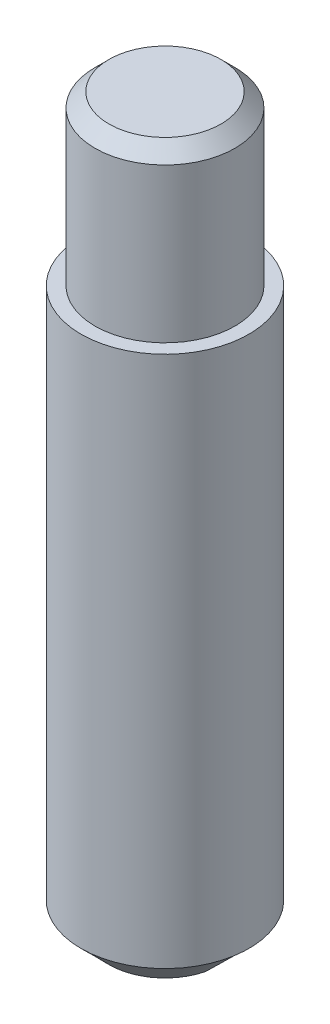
ISO-10303-21;
HEADER;
FILE_DESCRIPTION(('STEP AP214'),'2;1');
FILE_NAME('part.step','',(''),(''),'','','');
FILE_SCHEMA(('AUTOMOTIVE_DESIGN { 1 0 10303 214 1 1 1 1 }'));
ENDSEC;
DATA;
#1=APPLICATION_CONTEXT('core data for automotive mechanical design processes');
#2=APPLICATION_PROTOCOL_DEFINITION('international standard','automotive_design',2000,#1);
#3=PRODUCT_CONTEXT('',#1,'mechanical');
#4=PRODUCT('Part','Part','',(#3));
#5=PRODUCT_RELATED_PRODUCT_CATEGORY('part','',(#4));
#6=PRODUCT_DEFINITION_FORMATION('','',#4);
#7=PRODUCT_DEFINITION_CONTEXT('part definition',#1,'design');
#8=PRODUCT_DEFINITION('design','',#6,#7);
#9=PRODUCT_DEFINITION_SHAPE('','',#8);
#10=(LENGTH_UNIT() NAMED_UNIT(*) SI_UNIT(.MILLI.,.METRE.));
#11=(NAMED_UNIT(*) PLANE_ANGLE_UNIT() SI_UNIT($,.RADIAN.));
#12=(NAMED_UNIT(*) SI_UNIT($,.STERADIAN.) SOLID_ANGLE_UNIT());
#13=UNCERTAINTY_MEASURE_WITH_UNIT(LENGTH_MEASURE(1.E-05),#10,'distance_accuracy_value','');
#14=(GEOMETRIC_REPRESENTATION_CONTEXT(3) GLOBAL_UNCERTAINTY_ASSIGNED_CONTEXT((#13)) GLOBAL_UNIT_ASSIGNED_CONTEXT((#10,
#11,#12)) REPRESENTATION_CONTEXT('',''));
#15=CARTESIAN_POINT('',(0.,0.,0.));
#16=DIRECTION('',(0.,0.,1.));
#17=DIRECTION('',(1.,0.,0.));
#18=AXIS2_PLACEMENT_3D('',#15,#16,#17);
#19=CARTESIAN_POINT('',(0.,0.,0.));
#20=DIRECTION('',(0.,1.,0.));
#21=DIRECTION('',(0.,0.,1.));
#22=AXIS2_PLACEMENT_3D('',#19,#20,#21);
#23=PLANE('',#22);
#24=CARTESIAN_POINT('',(0.,0.,0.));
#25=DIRECTION('',(0.,1.,0.));
#26=DIRECTION('',(0.,0.,1.));
#27=AXIS2_PLACEMENT_3D('',#24,#25,#26);
#28=CIRCLE('',#27,1.99999999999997);
#29=CARTESIAN_POINT('',(-1.93649167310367,0.,-0.5));
#30=VERTEX_POINT('',#29);
#31=CARTESIAN_POINT('',(1.93649167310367,0.,-0.5));
#32=VERTEX_POINT('',#31);
#33=EDGE_CURVE('E92',#30,#32,#28,.F.);
#34=ORIENTED_EDGE('',*,*,#33,.T.);
#35=DIRECTION('',(1.,0.,0.));
#36=VECTOR('',#35,1.);
#37=CARTESIAN_POINT('',(-4.08603247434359,0.,-0.5));
#38=LINE('',#37,#36);
#39=EDGE_CURVE('E90',#30,#32,#38,.T.);
#40=ORIENTED_EDGE('',*,*,#39,.F.);
#41=EDGE_LOOP('',(#34,#40));
#42=FACE_BOUND('',#41,.T.);
#43=ADVANCED_FACE('F33',(#42),#23,.F.);
#44=CARTESIAN_POINT('',(0.,1.00000000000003,0.));
#45=DIRECTION('',(0.,1.,0.));
#46=DIRECTION('',(0.,0.,1.));
#47=AXIS2_PLACEMENT_3D('',#44,#45,#46);
#48=CONICAL_SURFACE('',#47,3.,0.785398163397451);
#49=CARTESIAN_POINT('',(-6.63103347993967,4.64985751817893,-0.5));
#50=CARTESIAN_POINT('',(-6.39629582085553,4.41579013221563,-0.5));
#51=CARTESIAN_POINT('',(-6.16152847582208,4.18175248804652,-0.5));
#52=CARTESIAN_POINT('',(-5.69188584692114,3.71376898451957,-0.5));
#53=CARTESIAN_POINT('',(-5.45701055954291,3.47982312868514,-0.5));
#54=CARTESIAN_POINT('',(-4.98691869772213,3.01187160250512,-0.5));
#55=CARTESIAN_POINT('',(-4.75170200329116,2.77786605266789,-0.5));
#56=CARTESIAN_POINT('',(-4.28105975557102,2.31008118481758,-0.5));
#57=CARTESIAN_POINT('',(-4.04563420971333,2.07630185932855,-0.5));
#58=CARTESIAN_POINT('',(-3.58442332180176,1.61900696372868,-0.5));
#59=CARTESIAN_POINT('',(-3.35865262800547,1.39547663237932,-0.5));
#60=CARTESIAN_POINT('',(-3.01954668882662,1.06061302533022,-0.5));
#61=CARTESIAN_POINT('',(-2.90643048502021,0.949058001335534,-0.5));
#62=CARTESIAN_POINT('',(-2.67999103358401,0.726160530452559,-0.5));
#63=CARTESIAN_POINT('',(-2.56666778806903,0.614818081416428,-0.5));
#64=CARTESIAN_POINT('',(-2.33977921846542,0.392498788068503,-0.5));
#65=CARTESIAN_POINT('',(-2.22621405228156,0.281521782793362,-0.5));
#66=CARTESIAN_POINT('',(-1.99861397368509,0.0600415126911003,-0.5));
#67=CARTESIAN_POINT('',(-1.88457904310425,-0.0504617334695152,-0.5));
#68=CARTESIAN_POINT('',(-1.65577376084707,-0.270666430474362,-0.5));
#69=CARTESIAN_POINT('',(-1.54100354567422,-0.38036802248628,-0.5));
#70=CARTESIAN_POINT('',(-1.36779766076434,-0.543800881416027,-0.5));
#71=CARTESIAN_POINT('',(-1.3098891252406,-0.598090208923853,-0.5));
#72=CARTESIAN_POINT('',(-1.19356388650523,-0.706121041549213,-0.5));
#73=CARTESIAN_POINT('',(-1.13514719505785,-0.759862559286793,-0.5));
#74=CARTESIAN_POINT('',(-1.04371167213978,-0.842784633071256,-0.5));
#75=CARTESIAN_POINT('',(-1.01095596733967,-0.872255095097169,-0.5));
#76=CARTESIAN_POINT('',(-0.945138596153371,-0.930859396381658,-0.5));
#77=CARTESIAN_POINT('',(-0.91207690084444,-0.959993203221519,-0.5));
#78=CARTESIAN_POINT('',(-0.845330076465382,-1.01800796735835,-0.5));
#79=CARTESIAN_POINT('',(-0.811642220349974,-1.04688579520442,-0.5));
#80=CARTESIAN_POINT('',(-0.743741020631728,-1.10400170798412,-0.5));
#81=CARTESIAN_POINT('',(-0.709527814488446,-1.1322399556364,-0.5));
#82=CARTESIAN_POINT('',(-0.640097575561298,-1.18803130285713,-0.5));
#83=CARTESIAN_POINT('',(-0.604874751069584,-1.21557723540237,-0.5));
#84=CARTESIAN_POINT('',(-0.533390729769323,-1.26928306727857,-0.5));
#85=CARTESIAN_POINT('',(-0.497129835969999,-1.29544336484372,-0.5));
#86=CARTESIAN_POINT('',(-0.423306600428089,-1.34543807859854,-0.5));
#87=CARTESIAN_POINT('',(-0.385752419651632,-1.36928438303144,-0.5));
#88=CARTESIAN_POINT('',(-0.308583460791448,-1.41329936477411,-0.5));
#89=CARTESIAN_POINT('',(-0.268974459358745,-1.43347770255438,-0.5));
#90=CARTESIAN_POINT('',(-0.197288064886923,-1.46320514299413,-0.5));
#91=CARTESIAN_POINT('',(-0.165811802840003,-1.47415077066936,-0.5));
#92=CARTESIAN_POINT('',(-0.10156042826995,-1.49072227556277,-0.5));
#93=CARTESIAN_POINT('',(-0.0687922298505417,-1.49637328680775,-0.5));
#94=CARTESIAN_POINT('',(-0.00241834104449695,-1.50109442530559,-0.5));
#95=CARTESIAN_POINT('',(0.0311924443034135,-1.50009829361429,-0.5));
#96=CARTESIAN_POINT('',(0.097641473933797,-1.49163681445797,-0.5));
#97=CARTESIAN_POINT('',(0.130476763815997,-1.48414987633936,-0.5));
#98=CARTESIAN_POINT('',(0.186425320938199,-1.46686488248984,-0.5));
#99=CARTESIAN_POINT('',(0.209891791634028,-1.45813493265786,-0.5));
#100=CARTESIAN_POINT('',(0.255987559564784,-1.43866809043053,-0.5));
#101=CARTESIAN_POINT('',(0.27861621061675,-1.42792968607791,-0.5));
#102=CARTESIAN_POINT('',(0.323210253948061,-1.40493918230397,-0.5));
#103=CARTESIAN_POINT('',(0.345172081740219,-1.39268029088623,-0.5));
#104=CARTESIAN_POINT('',(0.388439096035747,-1.36708370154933,-0.5));
#105=CARTESIAN_POINT('',(0.409744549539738,-1.35374645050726,-0.5));
#106=CARTESIAN_POINT('',(0.480878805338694,-1.30733418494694,-0.5));
#107=CARTESIAN_POINT('',(0.529498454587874,-1.27241897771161,-0.5));
#108=CARTESIAN_POINT('',(0.624968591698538,-1.2002322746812,-0.5));
#109=CARTESIAN_POINT('',(0.671817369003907,-1.16295858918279,-0.5));
#110=CARTESIAN_POINT('',(0.764476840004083,-1.0869153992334,-0.5));
#111=CARTESIAN_POINT('',(0.810284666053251,-1.04814240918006,-0.5));
#112=CARTESIAN_POINT('',(0.90110656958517,-0.969722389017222,-0.5));
#113=CARTESIAN_POINT('',(0.946120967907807,-0.930075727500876,-0.5));
#114=CARTESIAN_POINT('',(1.03570334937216,-0.850098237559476,-0.5));
#115=CARTESIAN_POINT('',(1.08027022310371,-0.809766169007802,-0.5));
#116=CARTESIAN_POINT('',(1.16901708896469,-0.72867062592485,-0.5));
#117=CARTESIAN_POINT('',(1.21319704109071,-0.687907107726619,-0.5));
#118=CARTESIAN_POINT('',(1.34516756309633,-0.565284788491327,-0.5));
#119=CARTESIAN_POINT('',(1.43253048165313,-0.482966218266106,-0.5));
#120=CARTESIAN_POINT('',(1.60576074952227,-0.318406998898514,-0.5));
#121=CARTESIAN_POINT('',(1.69163442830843,-0.236172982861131,-0.5));
#122=CARTESIAN_POINT('',(1.86295068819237,-0.071256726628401,-0.5));
#123=CARTESIAN_POINT('',(1.94839326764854,0.011425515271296,-0.5));
#124=CARTESIAN_POINT('',(2.2042966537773,0.259920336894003,-0.5));
#125=CARTESIAN_POINT('',(2.37432728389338,0.426175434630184,-0.5));
#126=CARTESIAN_POINT('',(2.71390428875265,0.759391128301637,-0.5));
#127=CARTESIAN_POINT('',(2.88345029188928,0.926352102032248,-0.5));
#128=CARTESIAN_POINT('',(3.22218395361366,1.26063177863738,-0.5));
#129=CARTESIAN_POINT('',(3.39137161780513,1.42795047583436,-0.5));
#130=CARTESIAN_POINT('',(3.72910055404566,1.76239888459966,-0.5));
#131=CARTESIAN_POINT('',(3.89764238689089,1.92952803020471,-0.5));
#132=CARTESIAN_POINT('',(4.23457368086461,2.2639412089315,-0.5));
#133=CARTESIAN_POINT('',(4.40296314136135,2.43122524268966,-0.5));
#134=CARTESIAN_POINT('',(4.90791715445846,2.93318294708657,-0.5));
#135=CARTESIAN_POINT('',(5.24432242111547,3.26801683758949,-0.5));
#136=CARTESIAN_POINT('',(5.66813547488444,3.69014087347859,-0.5));
#137=CARTESIAN_POINT('',(5.75565083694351,3.77732308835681,-0.5));
#138=CARTESIAN_POINT('',(5.93066959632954,3.95170437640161,-0.5));
#139=CARTESIAN_POINT('',(6.01817299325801,4.03890344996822,-0.5));
#140=CARTESIAN_POINT('',(6.1932434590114,4.21338987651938,-0.5));
#141=CARTESIAN_POINT('',(6.28081051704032,4.30067724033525,-0.5));
#142=CARTESIAN_POINT('',(6.45593115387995,4.47526062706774,-0.5));
#143=CARTESIAN_POINT('',(6.54348473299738,4.56255664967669,-0.5));
#144=CARTESIAN_POINT('',(6.63103347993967,4.64985751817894,-0.5));
#145=B_SPLINE_CURVE_WITH_KNOTS('',3,(#49,#50,#51,#52,#53,#54,#55,#56,#57,#58,#59,#60,#61,#62,
#63,#64,#65,#66,#67,#68,#69,#70,#71,#72,#73,#74,#75,#76,#77,#78,#79,#80,#81,#82,#83,#84,#85,#86,
#87,#88,#89,#90,#91,#92,#93,#94,#95,#96,#97,#98,#99,#100,#101,#102,#103,#104,#105,#106,#107,
#108,#109,#110,#111,#112,#113,#114,#115,#116,#117,#118,#119,#120,#121,#122,#123,#124,#125,#126,
#127,#128,#129,#130,#131,#132,#133,#134,#135,#136,#137,#138,#139,#140,#141,#142,#143,#144),
.UNSPECIFIED.,.F.,.F.,(4,2,2,2,2,2,2,2,2,2,2,2,2,2,2,2,2,2,2,2,2,2,2,2,2,2,2,2,2,2,2,2,2,2,2,2,
2,2,2,2,2,2,2,2,2,2,2,4),(0.,0.994486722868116,1.98900847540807,2.98438238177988,
3.97972218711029,4.9328447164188,5.40945566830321,5.88606177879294,6.36241822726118,
6.83879327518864,7.31508230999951,7.55321172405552,7.79133563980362,7.9235194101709,
8.05571580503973,8.18882389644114,8.32189773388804,8.45602191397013,8.59010733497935,
8.72346269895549,8.85646158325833,8.95611915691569,9.05530121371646,9.15547338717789,
9.25598005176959,9.33099001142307,9.40605666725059,9.48147161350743,9.55685546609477,
9.73626223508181,9.91583808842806,10.095860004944,10.2758073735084,10.4561250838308,
10.6364612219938,10.9965607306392,11.3532528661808,11.7099463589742,12.4233575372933,
13.1372171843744,13.8510655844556,14.5631374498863,15.2752122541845,16.6991291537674,
17.0697193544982,17.4403198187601,17.811242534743,18.1821549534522),.UNSPECIFIED.);
#146=CARTESIAN_POINT('',(-2.95803989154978,1.,-0.5));
#147=VERTEX_POINT('',#146);
#148=EDGE_CURVE('E11',#147,#30,#145,.T.);
#149=ORIENTED_EDGE('',*,*,#148,.F.);
#150=CARTESIAN_POINT('',(0.,1.00000000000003,0.));
#151=DIRECTION('',(0.,1.,0.));
#152=DIRECTION('',(0.,0.,1.));
#153=AXIS2_PLACEMENT_3D('',#150,#151,#152);
#154=CIRCLE('',#153,3.);
#155=CARTESIAN_POINT('',(2.95803989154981,1.00000000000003,-0.500000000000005));
#156=VERTEX_POINT('',#155);
#157=EDGE_CURVE('E97',#156,#147,#154,.T.);
#158=ORIENTED_EDGE('',*,*,#157,.F.);
#159=EDGE_CURVE('E38',#32,#156,#145,.T.);
#160=ORIENTED_EDGE('',*,*,#159,.F.);
#161=ORIENTED_EDGE('',*,*,#33,.F.);
#162=EDGE_LOOP('',(#149,#158,#160,#161));
#163=FACE_BOUND('',#162,.T.);
#164=ADVANCED_FACE('F129',(#163),#48,.T.);
#165=CARTESIAN_POINT('',(0.,26.,0.));
#166=DIRECTION('',(0.,-1.,0.));
#167=DIRECTION('',(0.,0.,-1.));
#168=AXIS2_PLACEMENT_3D('',#165,#166,#167);
#169=CYLINDRICAL_SURFACE('',#168,3.);
#170=CARTESIAN_POINT('',(2.95803989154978,1.,0.5));
#171=VERTEX_POINT('',#170);
#172=EDGE_CURVE('E93',#171,#156,#154,.T.);
#173=ORIENTED_EDGE('',*,*,#172,.T.);
#174=ORIENTED_EDGE('',*,*,#157,.T.);
#175=CARTESIAN_POINT('',(-2.95803989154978,1.,0.5));
#176=VERTEX_POINT('',#175);
#177=EDGE_CURVE('E165',#147,#176,#154,.T.);
#178=ORIENTED_EDGE('',*,*,#177,.T.);
#179=EDGE_CURVE('E99',#176,#171,#154,.T.);
#180=ORIENTED_EDGE('',*,*,#179,.T.);
#181=EDGE_LOOP('',(#173,#174,#178,#180));
#182=FACE_BOUND('',#181,.T.);
#183=CARTESIAN_POINT('',(0.,20.,0.));
#184=DIRECTION('',(0.,1.,0.));
#185=DIRECTION('',(0.,0.,1.));
#186=AXIS2_PLACEMENT_3D('',#183,#184,#185);
#187=CIRCLE('',#186,3.);
#188=CARTESIAN_POINT('',(0.,20.,3.));
#189=VERTEX_POINT('',#188);
#190=EDGE_CURVE('E158',#189,#189,#187,.T.);
#191=ORIENTED_EDGE('',*,*,#190,.F.);
#192=EDGE_LOOP('',(#191));
#193=FACE_BOUND('',#192,.T.);
#194=ADVANCED_FACE('F127',(#182,#193),#169,.T.);
#195=CARTESIAN_POINT('',(1.93649167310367,0.,0.5));
#196=VERTEX_POINT('',#195);
#197=CARTESIAN_POINT('',(-1.93649167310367,0.,0.5));
#198=VERTEX_POINT('',#197);
#199=EDGE_CURVE('E89',#196,#198,#28,.F.);
#200=ORIENTED_EDGE('',*,*,#199,.T.);
#201=DIRECTION('',(-1.,0.,0.));
#202=VECTOR('',#201,1.);
#203=CARTESIAN_POINT('',(-4.00820328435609,0.,0.5));
#204=LINE('',#203,#202);
#205=EDGE_CURVE('E80',#196,#198,#204,.T.);
#206=ORIENTED_EDGE('',*,*,#205,.F.);
#207=EDGE_LOOP('',(#200,#206));
#208=FACE_BOUND('',#207,.T.);
#209=ADVANCED_FACE('F88',(#208),#23,.F.);
#210=CARTESIAN_POINT('',(0.,20.,0.));
#211=DIRECTION('',(0.,1.,0.));
#212=DIRECTION('',(0.,0.,1.));
#213=AXIS2_PLACEMENT_3D('',#210,#211,#212);
#214=PLANE('',#213);
#215=CARTESIAN_POINT('',(0.,20.,0.));
#216=DIRECTION('',(0.,1.,0.));
#217=DIRECTION('',(0.,0.,1.));
#218=AXIS2_PLACEMENT_3D('',#215,#216,#217);
#219=CIRCLE('',#218,2.5);
#220=CARTESIAN_POINT('',(0.,20.,2.5));
#221=VERTEX_POINT('',#220);
#222=EDGE_CURVE('E155',#221,#221,#219,.T.);
#223=ORIENTED_EDGE('',*,*,#222,.F.);
#224=EDGE_LOOP('',(#223));
#225=FACE_BOUND('',#224,.T.);
#226=ORIENTED_EDGE('',*,*,#190,.T.);
#227=EDGE_LOOP('',(#226));
#228=FACE_BOUND('',#227,.T.);
#229=ADVANCED_FACE('F116',(#225,#228),#214,.T.);
#230=CARTESIAN_POINT('',(0.,20.,0.));
#231=DIRECTION('',(0.,1.,0.));
#232=DIRECTION('',(0.,0.,1.));
#233=AXIS2_PLACEMENT_3D('',#230,#231,#232);
#234=CYLINDRICAL_SURFACE('',#233,2.5);
#235=CARTESIAN_POINT('',(0.,25.5,0.));
#236=DIRECTION('',(0.,1.,0.));
#237=DIRECTION('',(0.,0.,1.));
#238=AXIS2_PLACEMENT_3D('',#235,#236,#237);
#239=CIRCLE('',#238,2.5);
#240=CARTESIAN_POINT('',(0.,25.5,2.5));
#241=VERTEX_POINT('',#240);
#242=EDGE_CURVE('E163',#241,#241,#239,.F.);
#243=ORIENTED_EDGE('',*,*,#242,.T.);
#244=EDGE_LOOP('',(#243));
#245=FACE_BOUND('',#244,.T.);
#246=ORIENTED_EDGE('',*,*,#222,.T.);
#247=EDGE_LOOP('',(#246));
#248=FACE_BOUND('',#247,.T.);
#249=ADVANCED_FACE('F112',(#245,#248),#234,.T.);
#250=CARTESIAN_POINT('',(0.,26.,0.));
#251=DIRECTION('',(0.,1.,0.));
#252=DIRECTION('',(0.,0.,1.));
#253=AXIS2_PLACEMENT_3D('',#250,#251,#252);
#254=PLANE('',#253);
#255=CARTESIAN_POINT('',(0.,26.,0.));
#256=DIRECTION('',(0.,1.,0.));
#257=DIRECTION('',(0.,0.,1.));
#258=AXIS2_PLACEMENT_3D('',#255,#256,#257);
#259=CIRCLE('',#258,2.);
#260=CARTESIAN_POINT('',(0.,26.,2.));
#261=VERTEX_POINT('',#260);
#262=EDGE_CURVE('E161',#261,#261,#259,.T.);
#263=ORIENTED_EDGE('',*,*,#262,.T.);
#264=EDGE_LOOP('',(#263));
#265=FACE_BOUND('',#264,.T.);
#266=ADVANCED_FACE('F115',(#265),#254,.T.);
#267=CARTESIAN_POINT('',(0.,26.,0.));
#268=DIRECTION('',(0.,-1.,0.));
#269=DIRECTION('',(0.,0.,-1.));
#270=AXIS2_PLACEMENT_3D('',#267,#268,#269);
#271=CONICAL_SURFACE('',#270,2.,0.785398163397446);
#272=ORIENTED_EDGE('',*,*,#242,.F.);
#273=EDGE_LOOP('',(#272));
#274=FACE_BOUND('',#273,.T.);
#275=ORIENTED_EDGE('',*,*,#262,.F.);
#276=EDGE_LOOP('',(#275));
#277=FACE_BOUND('',#276,.T.);
#278=ADVANCED_FACE('F123',(#274,#277),#271,.T.);
#279=CARTESIAN_POINT('',(6.63103347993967,4.64985751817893,0.5));
#280=CARTESIAN_POINT('',(6.39629582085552,4.41579013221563,0.5));
#281=CARTESIAN_POINT('',(6.16152847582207,4.18175248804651,0.5));
#282=CARTESIAN_POINT('',(5.69188584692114,3.71376898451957,0.5));
#283=CARTESIAN_POINT('',(5.4570105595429,3.47982312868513,0.5));
#284=CARTESIAN_POINT('',(4.98691869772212,3.01187160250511,0.5));
#285=CARTESIAN_POINT('',(4.75170200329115,2.77786605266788,0.5));
#286=CARTESIAN_POINT('',(4.28105975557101,2.31008118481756,0.5));
#287=CARTESIAN_POINT('',(4.04563420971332,2.07630185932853,0.5));
#288=CARTESIAN_POINT('',(3.58442332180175,1.61900696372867,0.5));
#289=CARTESIAN_POINT('',(3.35865262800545,1.39547663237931,0.5));
#290=CARTESIAN_POINT('',(3.01954668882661,1.06061302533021,0.5));
#291=CARTESIAN_POINT('',(2.9064304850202,0.949058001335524,0.5));
#292=CARTESIAN_POINT('',(2.679991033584,0.72616053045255,0.5));
#293=CARTESIAN_POINT('',(2.56666778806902,0.61481808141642,0.5));
#294=CARTESIAN_POINT('',(2.33977921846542,0.392498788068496,0.5));
#295=CARTESIAN_POINT('',(2.22621405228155,0.281521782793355,0.5));
#296=CARTESIAN_POINT('',(1.99861397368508,0.0600415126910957,0.5));
#297=CARTESIAN_POINT('',(1.88457904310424,-0.0504617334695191,0.5));
#298=CARTESIAN_POINT('',(1.65577376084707,-0.270666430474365,0.5));
#299=CARTESIAN_POINT('',(1.54100354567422,-0.380368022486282,0.5));
#300=CARTESIAN_POINT('',(1.36779766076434,-0.543800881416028,0.5));
#301=CARTESIAN_POINT('',(1.3098891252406,-0.598090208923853,0.5));
#302=CARTESIAN_POINT('',(1.19356388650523,-0.706121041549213,0.5));
#303=CARTESIAN_POINT('',(1.13514719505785,-0.759862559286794,0.5));
#304=CARTESIAN_POINT('',(1.04371167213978,-0.842784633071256,0.5));
#305=CARTESIAN_POINT('',(1.01095596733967,-0.872255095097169,0.5));
#306=CARTESIAN_POINT('',(0.945138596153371,-0.930859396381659,0.5));
#307=CARTESIAN_POINT('',(0.912076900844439,-0.95999320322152,0.5));
#308=CARTESIAN_POINT('',(0.845330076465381,-1.01800796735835,0.5));
#309=CARTESIAN_POINT('',(0.811642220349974,-1.04688579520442,0.5));
#310=CARTESIAN_POINT('',(0.743741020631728,-1.10400170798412,0.5));
#311=CARTESIAN_POINT('',(0.709527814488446,-1.1322399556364,0.5));
#312=CARTESIAN_POINT('',(0.640097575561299,-1.18803130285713,0.5));
#313=CARTESIAN_POINT('',(0.604874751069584,-1.21557723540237,0.5));
#314=CARTESIAN_POINT('',(0.533390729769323,-1.26928306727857,0.5));
#315=CARTESIAN_POINT('',(0.49712983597,-1.29544336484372,0.5));
#316=CARTESIAN_POINT('',(0.42330660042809,-1.34543807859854,0.5));
#317=CARTESIAN_POINT('',(0.385752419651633,-1.36928438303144,0.5));
#318=CARTESIAN_POINT('',(0.308583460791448,-1.41329936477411,0.5));
#319=CARTESIAN_POINT('',(0.268974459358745,-1.43347770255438,0.5));
#320=CARTESIAN_POINT('',(0.197288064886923,-1.46320514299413,0.5));
#321=CARTESIAN_POINT('',(0.165811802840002,-1.47415077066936,0.5));
#322=CARTESIAN_POINT('',(0.10156042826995,-1.49072227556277,0.5));
#323=CARTESIAN_POINT('',(0.0687922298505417,-1.49637328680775,0.5));
#324=CARTESIAN_POINT('',(0.00241834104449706,-1.50109442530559,0.5));
#325=CARTESIAN_POINT('',(-0.0311924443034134,-1.50009829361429,0.5));
#326=CARTESIAN_POINT('',(-0.0976414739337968,-1.49163681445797,0.5));
#327=CARTESIAN_POINT('',(-0.130476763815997,-1.48414987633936,0.5));
#328=CARTESIAN_POINT('',(-0.186425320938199,-1.46686488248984,0.5));
#329=CARTESIAN_POINT('',(-0.209891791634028,-1.45813493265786,0.5));
#330=CARTESIAN_POINT('',(-0.255987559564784,-1.43866809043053,0.5));
#331=CARTESIAN_POINT('',(-0.278616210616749,-1.42792968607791,0.5));
#332=CARTESIAN_POINT('',(-0.323210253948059,-1.40493918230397,0.5));
#333=CARTESIAN_POINT('',(-0.345172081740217,-1.39268029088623,0.5));
#334=CARTESIAN_POINT('',(-0.388439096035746,-1.36708370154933,0.5));
#335=CARTESIAN_POINT('',(-0.409744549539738,-1.35374645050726,0.5));
#336=CARTESIAN_POINT('',(-0.480878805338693,-1.30733418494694,0.5));
#337=CARTESIAN_POINT('',(-0.529498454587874,-1.27241897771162,0.5));
#338=CARTESIAN_POINT('',(-0.624968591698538,-1.2002322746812,0.5));
#339=CARTESIAN_POINT('',(-0.671817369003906,-1.16295858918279,0.5));
#340=CARTESIAN_POINT('',(-0.764476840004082,-1.08691539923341,0.5));
#341=CARTESIAN_POINT('',(-0.810284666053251,-1.04814240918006,0.5));
#342=CARTESIAN_POINT('',(-0.90110656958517,-0.969722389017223,0.5));
#343=CARTESIAN_POINT('',(-0.946120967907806,-0.930075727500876,0.5));
#344=CARTESIAN_POINT('',(-1.03570334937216,-0.850098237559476,0.5));
#345=CARTESIAN_POINT('',(-1.0802702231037,-0.809766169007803,0.5));
#346=CARTESIAN_POINT('',(-1.16901708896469,-0.728670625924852,0.5));
#347=CARTESIAN_POINT('',(-1.21319704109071,-0.687907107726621,0.5));
#348=CARTESIAN_POINT('',(-1.34516756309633,-0.56528478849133,0.5));
#349=CARTESIAN_POINT('',(-1.43253048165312,-0.482966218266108,0.5));
#350=CARTESIAN_POINT('',(-1.60576074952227,-0.318406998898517,0.5));
#351=CARTESIAN_POINT('',(-1.69163442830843,-0.236172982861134,0.5));
#352=CARTESIAN_POINT('',(-1.86295068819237,-0.0712567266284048,0.5));
#353=CARTESIAN_POINT('',(-1.94839326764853,0.0114255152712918,0.5));
#354=CARTESIAN_POINT('',(-2.2042966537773,0.259920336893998,0.5));
#355=CARTESIAN_POINT('',(-2.37432728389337,0.42617543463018,0.5));
#356=CARTESIAN_POINT('',(-2.71390428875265,0.759391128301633,0.5));
#357=CARTESIAN_POINT('',(-2.88345029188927,0.926352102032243,0.5));
#358=CARTESIAN_POINT('',(-3.22218395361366,1.26063177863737,0.5));
#359=CARTESIAN_POINT('',(-3.39137161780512,1.42795047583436,0.5));
#360=CARTESIAN_POINT('',(-3.72910055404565,1.76239888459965,0.5));
#361=CARTESIAN_POINT('',(-3.89764238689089,1.9295280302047,0.5));
#362=CARTESIAN_POINT('',(-4.2345736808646,2.2639412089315,0.5));
#363=CARTESIAN_POINT('',(-4.40296314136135,2.43122524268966,0.5));
#364=CARTESIAN_POINT('',(-4.90791715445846,2.93318294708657,0.5));
#365=CARTESIAN_POINT('',(-5.24432242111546,3.26801683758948,0.5));
#366=CARTESIAN_POINT('',(-5.66813547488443,3.69014087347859,0.5));
#367=CARTESIAN_POINT('',(-5.7556508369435,3.7773230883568,0.5));
#368=CARTESIAN_POINT('',(-5.93066959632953,3.9517043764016,0.5));
#369=CARTESIAN_POINT('',(-6.018172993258,4.03890344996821,0.5));
#370=CARTESIAN_POINT('',(-6.19324345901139,4.21338987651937,0.5));
#371=CARTESIAN_POINT('',(-6.28081051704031,4.30067724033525,0.5));
#372=CARTESIAN_POINT('',(-6.45593115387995,4.47526062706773,0.5));
#373=CARTESIAN_POINT('',(-6.54348473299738,4.56255664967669,0.5));
#374=CARTESIAN_POINT('',(-6.63103347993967,4.64985751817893,0.5));
#375=B_SPLINE_CURVE_WITH_KNOTS('',3,(#279,#280,#281,#282,#283,#284,#285,#286,#287,#288,#289,
#290,#291,#292,#293,#294,#295,#296,#297,#298,#299,#300,#301,#302,#303,#304,#305,#306,#307,#308,
#309,#310,#311,#312,#313,#314,#315,#316,#317,#318,#319,#320,#321,#322,#323,#324,#325,#326,#327,
#328,#329,#330,#331,#332,#333,#334,#335,#336,#337,#338,#339,#340,#341,#342,#343,#344,#345,#346,
#347,#348,#349,#350,#351,#352,#353,#354,#355,#356,#357,#358,#359,#360,#361,#362,#363,#364,#365,
#366,#367,#368,#369,#370,#371,#372,#373,#374),.UNSPECIFIED.,.F.,.F.,(4,2,2,2,2,2,2,2,2,2,2,2,2,
2,2,2,2,2,2,2,2,2,2,2,2,2,2,2,2,2,2,2,2,2,2,2,2,2,2,2,2,2,2,2,2,2,2,4),(0.,0.994486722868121,
1.98900847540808,2.98438238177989,3.97972218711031,4.93284471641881,5.40945566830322,
5.88606177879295,6.36241822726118,6.83879327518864,7.31508230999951,7.55321172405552,
7.79133563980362,7.9235194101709,8.05571580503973,8.18882389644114,8.32189773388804,
8.45602191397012,8.59010733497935,8.72346269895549,8.85646158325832,8.95611915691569,
9.05530121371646,9.15547338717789,9.25598005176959,9.33099001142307,9.40605666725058,
9.48147161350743,9.55685546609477,9.73626223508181,9.91583808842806,10.095860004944,
10.2758073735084,10.4561250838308,10.6364612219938,10.9965607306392,11.3532528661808,
11.7099463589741,12.4233575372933,13.1372171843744,13.8510655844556,14.5631374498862,
15.2752122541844,16.6991291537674,17.0697193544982,17.4403198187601,17.811242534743,
18.1821549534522),.UNSPECIFIED.);
#376=EDGE_CURVE('E77',#171,#196,#375,.T.);
#377=ORIENTED_EDGE('',*,*,#376,.F.);
#378=ORIENTED_EDGE('',*,*,#179,.F.);
#379=EDGE_CURVE('E61',#198,#176,#375,.T.);
#380=ORIENTED_EDGE('',*,*,#379,.F.);
#381=ORIENTED_EDGE('',*,*,#199,.F.);
#382=EDGE_LOOP('',(#377,#378,#380,#381));
#383=FACE_BOUND('',#382,.T.);
#384=ADVANCED_FACE('F35',(#383),#48,.T.);
#385=CARTESIAN_POINT('',(-4.08603247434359,1.,-0.5));
#386=DIRECTION('',(0.,0.,-1.));
#387=DIRECTION('',(-1.,0.,0.));
#388=AXIS2_PLACEMENT_3D('',#385,#386,#387);
#389=PLANE('',#388);
#390=ORIENTED_EDGE('',*,*,#148,.T.);
#391=ORIENTED_EDGE('',*,*,#39,.T.);
#392=ORIENTED_EDGE('',*,*,#159,.T.);
#393=DIRECTION('',(1.,0.,0.));
#394=VECTOR('',#393,1.);
#395=CARTESIAN_POINT('',(-4.08603247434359,1.,-0.5));
#396=LINE('',#395,#394);
#397=EDGE_CURVE('E53',#147,#156,#396,.T.);
#398=ORIENTED_EDGE('',*,*,#397,.F.);
#399=EDGE_LOOP('',(#390,#391,#392,#398));
#400=FACE_BOUND('',#399,.T.);
#401=ADVANCED_FACE('F109',(#400),#389,.F.);
#402=CARTESIAN_POINT('',(-4.00820328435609,1.,0.5));
#403=DIRECTION('',(0.,0.,1.));
#404=DIRECTION('',(1.,0.,0.));
#405=AXIS2_PLACEMENT_3D('',#402,#403,#404);
#406=PLANE('',#405);
#407=ORIENTED_EDGE('',*,*,#376,.T.);
#408=ORIENTED_EDGE('',*,*,#205,.T.);
#409=ORIENTED_EDGE('',*,*,#379,.T.);
#410=DIRECTION('',(-1.,0.,0.));
#411=VECTOR('',#410,1.);
#412=CARTESIAN_POINT('',(-4.00820328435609,1.,0.5));
#413=LINE('',#412,#411);
#414=EDGE_CURVE('E81',#171,#176,#413,.T.);
#415=ORIENTED_EDGE('',*,*,#414,.F.);
#416=EDGE_LOOP('',(#407,#408,#409,#415));
#417=FACE_BOUND('',#416,.T.);
#418=ADVANCED_FACE('F79',(#417),#406,.F.);
#419=CARTESIAN_POINT('',(4.14440436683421,1.,-0.5));
#420=DIRECTION('',(0.,-1.,0.));
#421=DIRECTION('',(0.,0.,-1.));
#422=AXIS2_PLACEMENT_3D('',#419,#420,#421);
#423=PLANE('',#422);
#424=ORIENTED_EDGE('',*,*,#397,.T.);
#425=ORIENTED_EDGE('',*,*,#172,.F.);
#426=ORIENTED_EDGE('',*,*,#414,.T.);
#427=ORIENTED_EDGE('',*,*,#177,.F.);
#428=EDGE_LOOP('',(#424,#425,#426,#427));
#429=FACE_BOUND('',#428,.T.);
#430=ADVANCED_FACE('F108',(#429),#423,.T.);
#431=CLOSED_SHELL('',(#43,#164,#194,#209,#229,#249,#266,#278,#384,#401,#418,#430));
#432=MANIFOLD_SOLID_BREP('B2',#431);
#433=ADVANCED_BREP_SHAPE_REPRESENTATION('',(#18,#432),#14);
#434=SHAPE_DEFINITION_REPRESENTATION(#9,#433);
ENDSEC;
END-ISO-10303-21;
